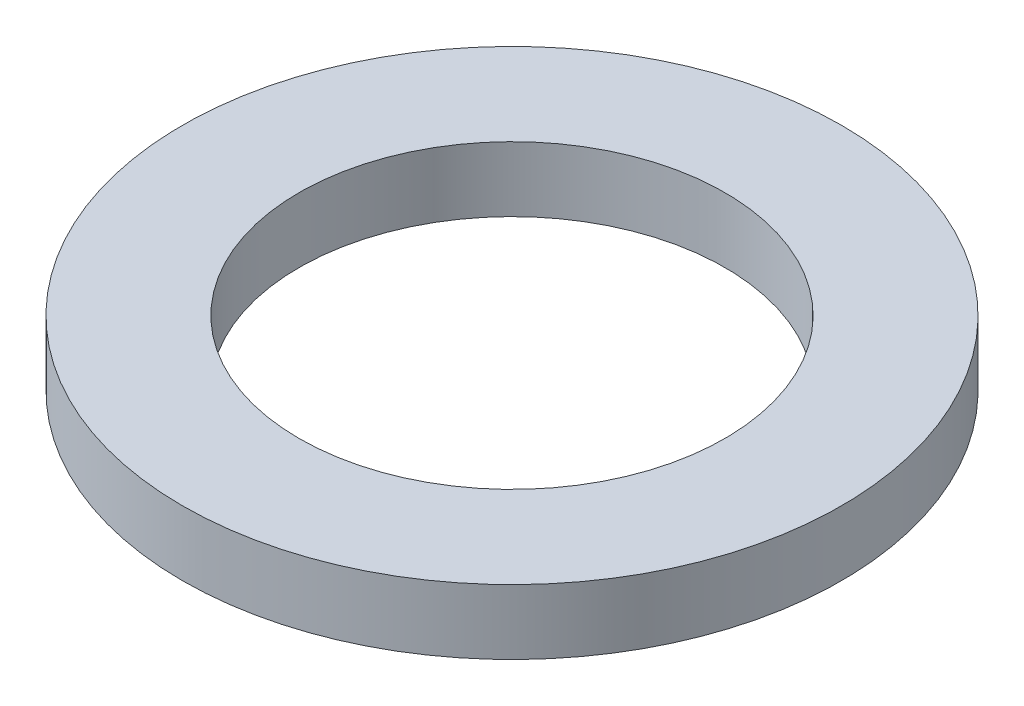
ISO-10303-21;
HEADER;
FILE_DESCRIPTION(('STEP AP214'),'2;1');
FILE_NAME('part.step','',(''),(''),'','','');
FILE_SCHEMA(('AUTOMOTIVE_DESIGN { 1 0 10303 214 1 1 1 1 }'));
ENDSEC;
DATA;
#1=APPLICATION_CONTEXT('core data for automotive mechanical design processes');
#2=APPLICATION_PROTOCOL_DEFINITION('international standard','automotive_design',2000,#1);
#3=PRODUCT_CONTEXT('',#1,'mechanical');
#4=PRODUCT('Part','Part','',(#3));
#5=PRODUCT_RELATED_PRODUCT_CATEGORY('part','',(#4));
#6=PRODUCT_DEFINITION_FORMATION('','',#4);
#7=PRODUCT_DEFINITION_CONTEXT('part definition',#1,'design');
#8=PRODUCT_DEFINITION('design','',#6,#7);
#9=PRODUCT_DEFINITION_SHAPE('','',#8);
#10=(LENGTH_UNIT() NAMED_UNIT(*) SI_UNIT(.MILLI.,.METRE.));
#11=(NAMED_UNIT(*) PLANE_ANGLE_UNIT() SI_UNIT($,.RADIAN.));
#12=(NAMED_UNIT(*) SI_UNIT($,.STERADIAN.) SOLID_ANGLE_UNIT());
#13=UNCERTAINTY_MEASURE_WITH_UNIT(LENGTH_MEASURE(1.E-05),#10,'distance_accuracy_value','');
#14=(GEOMETRIC_REPRESENTATION_CONTEXT(3) GLOBAL_UNCERTAINTY_ASSIGNED_CONTEXT((#13)) GLOBAL_UNIT_ASSIGNED_CONTEXT((#10,
#11,#12)) REPRESENTATION_CONTEXT('',''));
#15=CARTESIAN_POINT('',(0.,0.,0.));
#16=DIRECTION('',(0.,0.,1.));
#17=DIRECTION('',(1.,0.,0.));
#18=AXIS2_PLACEMENT_3D('',#15,#16,#17);
#19=CARTESIAN_POINT('',(0.,4.064,0.));
#20=DIRECTION('',(0.,1.,0.));
#21=DIRECTION('',(0.,0.,1.));
#22=AXIS2_PLACEMENT_3D('',#19,#20,#21);
#23=PLANE('',#22);
#24=CARTESIAN_POINT('',(0.,4.064,0.));
#25=DIRECTION('',(0.,1.,0.));
#26=DIRECTION('',(0.,0.,1.));
#27=AXIS2_PLACEMENT_3D('',#24,#25,#26);
#28=CIRCLE('',#27,20.6375);
#29=CARTESIAN_POINT('',(0.,4.064,20.6375));
#30=VERTEX_POINT('',#29);
#31=EDGE_CURVE('E10',#30,#30,#28,.T.);
#32=ORIENTED_EDGE('',*,*,#31,.T.);
#33=EDGE_LOOP('',(#32));
#34=FACE_BOUND('',#33,.T.);
#35=CARTESIAN_POINT('',(0.,4.064,0.));
#36=DIRECTION('',(0.,1.,0.));
#37=DIRECTION('',(0.,0.,1.));
#38=AXIS2_PLACEMENT_3D('',#35,#36,#37);
#39=CIRCLE('',#38,13.335);
#40=CARTESIAN_POINT('',(0.,4.064,13.335));
#41=VERTEX_POINT('',#40);
#42=EDGE_CURVE('E37',#41,#41,#39,.T.);
#43=ORIENTED_EDGE('',*,*,#42,.F.);
#44=EDGE_LOOP('',(#43));
#45=FACE_BOUND('',#44,.T.);
#46=ADVANCED_FACE('F26',(#34,#45),#23,.T.);
#47=CARTESIAN_POINT('',(0.,0.,0.));
#48=DIRECTION('',(0.,1.,0.));
#49=DIRECTION('',(0.,0.,1.));
#50=AXIS2_PLACEMENT_3D('',#47,#48,#49);
#51=PLANE('',#50);
#52=CARTESIAN_POINT('',(0.,0.,0.));
#53=DIRECTION('',(0.,1.,0.));
#54=DIRECTION('',(0.,0.,1.));
#55=AXIS2_PLACEMENT_3D('',#52,#53,#54);
#56=CIRCLE('',#55,20.6375);
#57=CARTESIAN_POINT('',(0.,0.,20.6375));
#58=VERTEX_POINT('',#57);
#59=EDGE_CURVE('E33',#58,#58,#56,.T.);
#60=ORIENTED_EDGE('',*,*,#59,.F.);
#61=EDGE_LOOP('',(#60));
#62=FACE_BOUND('',#61,.T.);
#63=CARTESIAN_POINT('',(0.,0.,0.));
#64=DIRECTION('',(0.,1.,0.));
#65=DIRECTION('',(0.,0.,1.));
#66=AXIS2_PLACEMENT_3D('',#63,#64,#65);
#67=CIRCLE('',#66,13.335);
#68=CARTESIAN_POINT('',(0.,0.,13.335));
#69=VERTEX_POINT('',#68);
#70=EDGE_CURVE('E41',#69,#69,#67,.T.);
#71=ORIENTED_EDGE('',*,*,#70,.T.);
#72=EDGE_LOOP('',(#71));
#73=FACE_BOUND('',#72,.T.);
#74=ADVANCED_FACE('F47',(#62,#73),#51,.F.);
#75=CARTESIAN_POINT('',(0.,4.064,0.));
#76=DIRECTION('',(0.,-1.,0.));
#77=DIRECTION('',(0.,0.,-1.));
#78=AXIS2_PLACEMENT_3D('',#75,#76,#77);
#79=CYLINDRICAL_SURFACE('',#78,20.6375);
#80=ORIENTED_EDGE('',*,*,#31,.F.);
#81=EDGE_LOOP('',(#80));
#82=FACE_BOUND('',#81,.T.);
#83=ORIENTED_EDGE('',*,*,#59,.T.);
#84=EDGE_LOOP('',(#83));
#85=FACE_BOUND('',#84,.T.);
#86=ADVANCED_FACE('F28',(#82,#85),#79,.T.);
#87=CARTESIAN_POINT('',(0.,4.064,0.));
#88=DIRECTION('',(0.,-1.,0.));
#89=DIRECTION('',(0.,0.,-1.));
#90=AXIS2_PLACEMENT_3D('',#87,#88,#89);
#91=CYLINDRICAL_SURFACE('',#90,13.335);
#92=ORIENTED_EDGE('',*,*,#42,.T.);
#93=EDGE_LOOP('',(#92));
#94=FACE_BOUND('',#93,.T.);
#95=ORIENTED_EDGE('',*,*,#70,.F.);
#96=EDGE_LOOP('',(#95));
#97=FACE_BOUND('',#96,.T.);
#98=ADVANCED_FACE('F49',(#94,#97),#91,.F.);
#99=CLOSED_SHELL('',(#46,#74,#86,#98));
#100=MANIFOLD_SOLID_BREP('B2',#99);
#101=ADVANCED_BREP_SHAPE_REPRESENTATION('',(#18,#100),#14);
#102=SHAPE_DEFINITION_REPRESENTATION(#9,#101);
ENDSEC;
END-ISO-10303-21;
